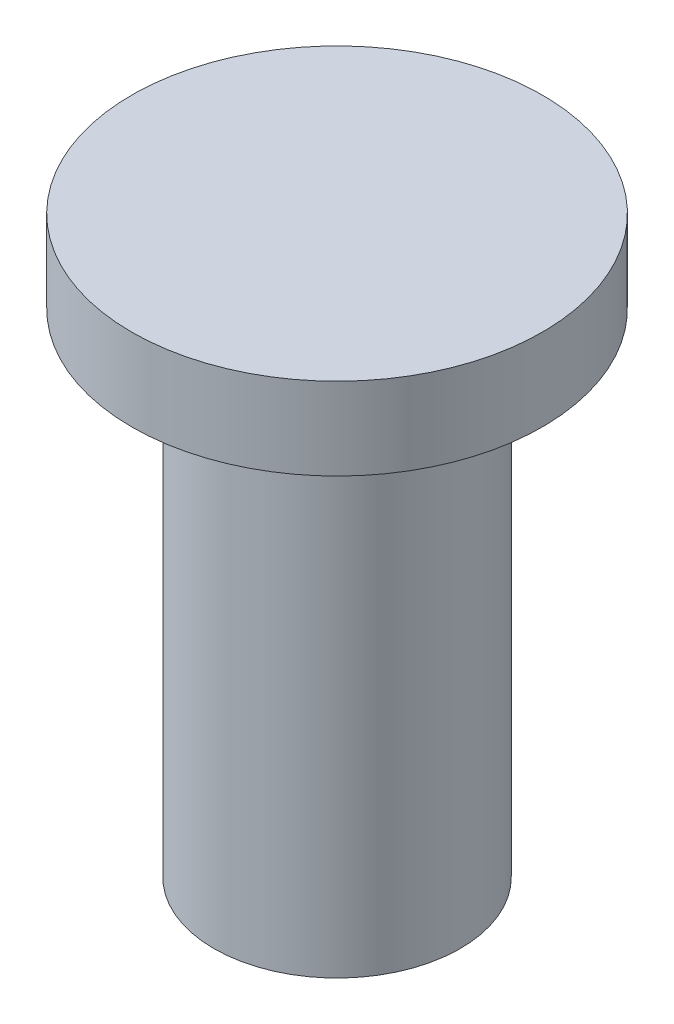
ISO-10303-21;
HEADER;
FILE_DESCRIPTION(('STEP AP214'),'2;1');
FILE_NAME('part.step','',(''),(''),'','','');
FILE_SCHEMA(('AUTOMOTIVE_DESIGN { 1 0 10303 214 1 1 1 1 }'));
ENDSEC;
DATA;
#1=APPLICATION_CONTEXT('core data for automotive mechanical design processes');
#2=APPLICATION_PROTOCOL_DEFINITION('international standard','automotive_design',2000,#1);
#3=PRODUCT_CONTEXT('',#1,'mechanical');
#4=PRODUCT('Part','Part','',(#3));
#5=PRODUCT_RELATED_PRODUCT_CATEGORY('part','',(#4));
#6=PRODUCT_DEFINITION_FORMATION('','',#4);
#7=PRODUCT_DEFINITION_CONTEXT('part definition',#1,'design');
#8=PRODUCT_DEFINITION('design','',#6,#7);
#9=PRODUCT_DEFINITION_SHAPE('','',#8);
#10=(LENGTH_UNIT() NAMED_UNIT(*) SI_UNIT(.MILLI.,.METRE.));
#11=(NAMED_UNIT(*) PLANE_ANGLE_UNIT() SI_UNIT($,.RADIAN.));
#12=(NAMED_UNIT(*) SI_UNIT($,.STERADIAN.) SOLID_ANGLE_UNIT());
#13=UNCERTAINTY_MEASURE_WITH_UNIT(LENGTH_MEASURE(1.E-05),#10,'distance_accuracy_value','');
#14=(GEOMETRIC_REPRESENTATION_CONTEXT(3) GLOBAL_UNCERTAINTY_ASSIGNED_CONTEXT((#13)) GLOBAL_UNIT_ASSIGNED_CONTEXT((#10,
#11,#12)) REPRESENTATION_CONTEXT('',''));
#15=CARTESIAN_POINT('',(0.,0.,0.));
#16=DIRECTION('',(0.,0.,1.));
#17=DIRECTION('',(1.,0.,0.));
#18=AXIS2_PLACEMENT_3D('',#15,#16,#17);
#19=CARTESIAN_POINT('',(0.,29.0537974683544,0.));
#20=DIRECTION('',(0.,-1.,0.));
#21=DIRECTION('',(0.,0.,-1.));
#22=AXIS2_PLACEMENT_3D('',#19,#20,#21);
#23=CYLINDRICAL_SURFACE('',#22,6.75);
#24=CARTESIAN_POINT('',(0.,29.0537974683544,0.));
#25=DIRECTION('',(0.,1.,0.));
#26=DIRECTION('',(0.,0.,1.));
#27=AXIS2_PLACEMENT_3D('',#24,#25,#26);
#28=CIRCLE('',#27,6.75);
#29=CARTESIAN_POINT('',(0.,29.0537974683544,6.75));
#30=VERTEX_POINT('',#29);
#31=EDGE_CURVE('E10',#30,#30,#28,.T.);
#32=ORIENTED_EDGE('',*,*,#31,.F.);
#33=EDGE_LOOP('',(#32));
#34=FACE_BOUND('',#33,.T.);
#35=CARTESIAN_POINT('',(0.,2.05379746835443,0.));
#36=DIRECTION('',(0.,1.,0.));
#37=DIRECTION('',(0.,0.,1.));
#38=AXIS2_PLACEMENT_3D('',#35,#36,#37);
#39=CIRCLE('',#38,6.75);
#40=CARTESIAN_POINT('',(0.,2.05379746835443,6.75));
#41=VERTEX_POINT('',#40);
#42=EDGE_CURVE('E39',#41,#41,#39,.T.);
#43=ORIENTED_EDGE('',*,*,#42,.T.);
#44=EDGE_LOOP('',(#43));
#45=FACE_BOUND('',#44,.T.);
#46=ADVANCED_FACE('F36',(#34,#45),#23,.T.);
#47=CARTESIAN_POINT('',(0.,2.05379746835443,0.));
#48=DIRECTION('',(0.,1.,0.));
#49=DIRECTION('',(0.,0.,1.));
#50=AXIS2_PLACEMENT_3D('',#47,#48,#49);
#51=PLANE('',#50);
#52=ORIENTED_EDGE('',*,*,#42,.F.);
#53=EDGE_LOOP('',(#52));
#54=FACE_BOUND('',#53,.T.);
#55=ADVANCED_FACE('F59',(#54),#51,.F.);
#56=CARTESIAN_POINT('',(0.,33.5537974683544,0.));
#57=DIRECTION('',(0.,-1.,0.));
#58=DIRECTION('',(0.,0.,-1.));
#59=AXIS2_PLACEMENT_3D('',#56,#57,#58);
#60=CYLINDRICAL_SURFACE('',#59,11.25);
#61=CARTESIAN_POINT('',(0.,33.5537974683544,0.));
#62=DIRECTION('',(0.,1.,0.));
#63=DIRECTION('',(0.,0.,1.));
#64=AXIS2_PLACEMENT_3D('',#61,#62,#63);
#65=CIRCLE('',#64,11.25);
#66=CARTESIAN_POINT('',(0.,33.5537974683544,11.25));
#67=VERTEX_POINT('',#66);
#68=EDGE_CURVE('E46',#67,#67,#65,.T.);
#69=ORIENTED_EDGE('',*,*,#68,.F.);
#70=EDGE_LOOP('',(#69));
#71=FACE_BOUND('',#70,.T.);
#72=CARTESIAN_POINT('',(0.,29.0537974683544,0.));
#73=DIRECTION('',(0.,1.,0.));
#74=DIRECTION('',(0.,0.,1.));
#75=AXIS2_PLACEMENT_3D('',#72,#73,#74);
#76=CIRCLE('',#75,11.25);
#77=CARTESIAN_POINT('',(0.,29.0537974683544,11.25));
#78=VERTEX_POINT('',#77);
#79=EDGE_CURVE('E48',#78,#78,#76,.T.);
#80=ORIENTED_EDGE('',*,*,#79,.T.);
#81=EDGE_LOOP('',(#80));
#82=FACE_BOUND('',#81,.T.);
#83=ADVANCED_FACE('F56',(#71,#82),#60,.T.);
#84=CARTESIAN_POINT('',(0.,33.5537974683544,0.));
#85=DIRECTION('',(0.,1.,0.));
#86=DIRECTION('',(0.,0.,1.));
#87=AXIS2_PLACEMENT_3D('',#84,#85,#86);
#88=PLANE('',#87);
#89=ORIENTED_EDGE('',*,*,#68,.T.);
#90=EDGE_LOOP('',(#89));
#91=FACE_BOUND('',#90,.T.);
#92=ADVANCED_FACE('F54',(#91),#88,.T.);
#93=CARTESIAN_POINT('',(0.,29.0537974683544,0.));
#94=DIRECTION('',(0.,1.,0.));
#95=DIRECTION('',(0.,0.,1.));
#96=AXIS2_PLACEMENT_3D('',#93,#94,#95);
#97=PLANE('',#96);
#98=ORIENTED_EDGE('',*,*,#31,.T.);
#99=EDGE_LOOP('',(#98));
#100=FACE_BOUND('',#99,.T.);
#101=ORIENTED_EDGE('',*,*,#79,.F.);
#102=EDGE_LOOP('',(#101));
#103=FACE_BOUND('',#102,.T.);
#104=ADVANCED_FACE('F63',(#100,#103),#97,.F.);
#105=CLOSED_SHELL('',(#46,#55,#83,#92,#104));
#106=MANIFOLD_SOLID_BREP('B2',#105);
#107=ADVANCED_BREP_SHAPE_REPRESENTATION('',(#18,#106),#14);
#108=SHAPE_DEFINITION_REPRESENTATION(#9,#107);
ENDSEC;
END-ISO-10303-21;
